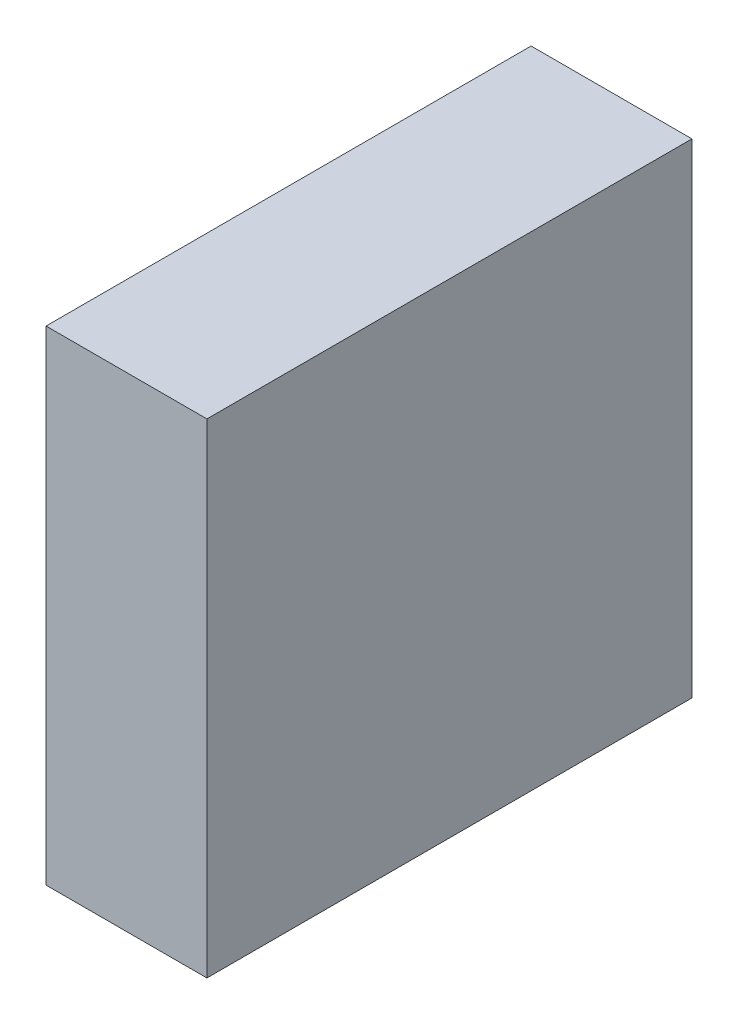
ISO-10303-21;
HEADER;
FILE_DESCRIPTION(('STEP AP214'),'2;1');
FILE_NAME('part.step','',(''),(''),'','','');
FILE_SCHEMA(('AUTOMOTIVE_DESIGN { 1 0 10303 214 1 1 1 1 }'));
ENDSEC;
DATA;
#1=APPLICATION_CONTEXT('core data for automotive mechanical design processes');
#2=APPLICATION_PROTOCOL_DEFINITION('international standard','automotive_design',2000,#1);
#3=PRODUCT_CONTEXT('',#1,'mechanical');
#4=PRODUCT('Part','Part','',(#3));
#5=PRODUCT_RELATED_PRODUCT_CATEGORY('part','',(#4));
#6=PRODUCT_DEFINITION_FORMATION('','',#4);
#7=PRODUCT_DEFINITION_CONTEXT('part definition',#1,'design');
#8=PRODUCT_DEFINITION('design','',#6,#7);
#9=PRODUCT_DEFINITION_SHAPE('','',#8);
#10=(LENGTH_UNIT() NAMED_UNIT(*) SI_UNIT(.MILLI.,.METRE.));
#11=(NAMED_UNIT(*) PLANE_ANGLE_UNIT() SI_UNIT($,.RADIAN.));
#12=(NAMED_UNIT(*) SI_UNIT($,.STERADIAN.) SOLID_ANGLE_UNIT());
#13=UNCERTAINTY_MEASURE_WITH_UNIT(LENGTH_MEASURE(1.E-05),#10,'distance_accuracy_value','');
#14=(GEOMETRIC_REPRESENTATION_CONTEXT(3) GLOBAL_UNCERTAINTY_ASSIGNED_CONTEXT((#13)) GLOBAL_UNIT_ASSIGNED_CONTEXT((#10,
#11,#12)) REPRESENTATION_CONTEXT('',''));
#15=CARTESIAN_POINT('',(0.,0.,0.));
#16=DIRECTION('',(0.,0.,1.));
#17=DIRECTION('',(1.,0.,0.));
#18=AXIS2_PLACEMENT_3D('',#15,#16,#17);
#19=CARTESIAN_POINT('',(0.,0.,0.5999988));
#20=DIRECTION('',(0.,0.,-1.));
#21=DIRECTION('',(0.,-1.,0.));
#22=AXIS2_PLACEMENT_3D('',#19,#20,#21);
#23=PLANE('',#22);
#24=DIRECTION('',(-1.,0.,0.));
#25=VECTOR('',#24,1.);
#26=CARTESIAN_POINT('',(0.09949180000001,-0.2994914,0.5999988));
#27=LINE('',#26,#25);
#28=CARTESIAN_POINT('',(0.09949180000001,-0.2994914,0.5999988));
#29=VERTEX_POINT('',#28);
#30=CARTESIAN_POINT('',(-0.09949179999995,-0.2994914,0.5999988));
#31=VERTEX_POINT('',#30);
#32=EDGE_CURVE('E27',#29,#31,#27,.T.);
#33=ORIENTED_EDGE('',*,*,#32,.F.);
#34=DIRECTION('',(0.,-1.,0.));
#35=VECTOR('',#34,1.);
#36=CARTESIAN_POINT('',(0.09949180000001,0.2994914,0.5999988));
#37=LINE('',#36,#35);
#38=CARTESIAN_POINT('',(0.09949180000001,0.2994914,0.5999988));
#39=VERTEX_POINT('',#38);
#40=EDGE_CURVE('E61',#39,#29,#37,.T.);
#41=ORIENTED_EDGE('',*,*,#40,.F.);
#42=DIRECTION('',(1.,0.,0.));
#43=VECTOR('',#42,1.);
#44=CARTESIAN_POINT('',(-0.09949179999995,0.2994914,0.5999988));
#45=LINE('',#44,#43);
#46=CARTESIAN_POINT('',(-0.09949179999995,0.2994914,0.5999988));
#47=VERTEX_POINT('',#46);
#48=EDGE_CURVE('E65',#47,#39,#45,.T.);
#49=ORIENTED_EDGE('',*,*,#48,.F.);
#50=DIRECTION('',(0.,1.,0.));
#51=VECTOR('',#50,1.);
#52=CARTESIAN_POINT('',(-0.09949179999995,-0.2994914,0.5999988));
#53=LINE('',#52,#51);
#54=EDGE_CURVE('E109',#31,#47,#53,.T.);
#55=ORIENTED_EDGE('',*,*,#54,.F.);
#56=EDGE_LOOP('',(#33,#41,#49,#55));
#57=FACE_BOUND('',#56,.T.);
#58=ADVANCED_FACE('F17',(#57),#23,.F.);
#59=CARTESIAN_POINT('',(0.,0.,0.));
#60=DIRECTION('',(0.,0.,-1.));
#61=DIRECTION('',(0.,-1.,0.));
#62=AXIS2_PLACEMENT_3D('',#59,#60,#61);
#63=PLANE('',#62);
#64=DIRECTION('',(0.,1.,0.));
#65=VECTOR('',#64,1.);
#66=CARTESIAN_POINT('',(-0.09949179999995,-0.2994914,0.));
#67=LINE('',#66,#65);
#68=CARTESIAN_POINT('',(-0.09949179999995,-0.2994914,0.));
#69=VERTEX_POINT('',#68);
#70=CARTESIAN_POINT('',(-0.09949179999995,0.2994914,0.));
#71=VERTEX_POINT('',#70);
#72=EDGE_CURVE('E86',#69,#71,#67,.T.);
#73=ORIENTED_EDGE('',*,*,#72,.T.);
#74=DIRECTION('',(1.,0.,0.));
#75=VECTOR('',#74,1.);
#76=CARTESIAN_POINT('',(-0.09949179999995,0.2994914,0.));
#77=LINE('',#76,#75);
#78=CARTESIAN_POINT('',(0.09949180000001,0.2994914,0.));
#79=VERTEX_POINT('',#78);
#80=EDGE_CURVE('E72',#71,#79,#77,.T.);
#81=ORIENTED_EDGE('',*,*,#80,.T.);
#82=DIRECTION('',(0.,-1.,0.));
#83=VECTOR('',#82,1.);
#84=CARTESIAN_POINT('',(0.09949180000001,0.2994914,0.));
#85=LINE('',#84,#83);
#86=CARTESIAN_POINT('',(0.09949180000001,-0.2994914,0.));
#87=VERTEX_POINT('',#86);
#88=EDGE_CURVE('E76',#79,#87,#85,.T.);
#89=ORIENTED_EDGE('',*,*,#88,.T.);
#90=DIRECTION('',(-1.,0.,0.));
#91=VECTOR('',#90,1.);
#92=CARTESIAN_POINT('',(0.09949180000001,-0.2994914,0.));
#93=LINE('',#92,#91);
#94=EDGE_CURVE('E11',#87,#69,#93,.T.);
#95=ORIENTED_EDGE('',*,*,#94,.T.);
#96=EDGE_LOOP('',(#73,#81,#89,#95));
#97=FACE_BOUND('',#96,.T.);
#98=ADVANCED_FACE('F156',(#97),#63,.T.);
#99=CARTESIAN_POINT('',(0.09949180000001,-0.2994914,0.));
#100=DIRECTION('',(0.,-1.,0.));
#101=DIRECTION('',(0.,0.,-1.));
#102=AXIS2_PLACEMENT_3D('',#99,#100,#101);
#103=PLANE('',#102);
#104=DIRECTION('',(0.,0.,1.));
#105=VECTOR('',#104,1.);
#106=CARTESIAN_POINT('',(0.09949180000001,-0.2994914,0.));
#107=LINE('',#106,#105);
#108=EDGE_CURVE('E71',#87,#29,#107,.T.);
#109=ORIENTED_EDGE('',*,*,#108,.T.);
#110=ORIENTED_EDGE('',*,*,#32,.T.);
#111=DIRECTION('',(0.,0.,1.));
#112=VECTOR('',#111,1.);
#113=CARTESIAN_POINT('',(-0.09949179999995,-0.2994914,0.));
#114=LINE('',#113,#112);
#115=EDGE_CURVE('E108',#69,#31,#114,.T.);
#116=ORIENTED_EDGE('',*,*,#115,.F.);
#117=ORIENTED_EDGE('',*,*,#94,.F.);
#118=EDGE_LOOP('',(#109,#110,#116,#117));
#119=FACE_BOUND('',#118,.T.);
#120=ADVANCED_FACE('F105',(#119),#103,.T.);
#121=CARTESIAN_POINT('',(0.09949180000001,0.2994914,0.));
#122=DIRECTION('',(1.,0.,0.));
#123=DIRECTION('',(0.,1.,0.));
#124=AXIS2_PLACEMENT_3D('',#121,#122,#123);
#125=PLANE('',#124);
#126=DIRECTION('',(0.,0.,1.));
#127=VECTOR('',#126,1.);
#128=CARTESIAN_POINT('',(0.09949180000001,0.2994914,0.));
#129=LINE('',#128,#127);
#130=EDGE_CURVE('E75',#79,#39,#129,.T.);
#131=ORIENTED_EDGE('',*,*,#130,.T.);
#132=ORIENTED_EDGE('',*,*,#40,.T.);
#133=ORIENTED_EDGE('',*,*,#108,.F.);
#134=ORIENTED_EDGE('',*,*,#88,.F.);
#135=EDGE_LOOP('',(#131,#132,#133,#134));
#136=FACE_BOUND('',#135,.T.);
#137=ADVANCED_FACE('F19',(#136),#125,.T.);
#138=CARTESIAN_POINT('',(-0.09949179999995,0.2994914,0.));
#139=DIRECTION('',(0.,1.,0.));
#140=DIRECTION('',(1.,0.,0.));
#141=AXIS2_PLACEMENT_3D('',#138,#139,#140);
#142=PLANE('',#141);
#143=DIRECTION('',(0.,0.,1.));
#144=VECTOR('',#143,1.);
#145=CARTESIAN_POINT('',(-0.09949179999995,0.2994914,0.));
#146=LINE('',#145,#144);
#147=EDGE_CURVE('E83',#71,#47,#146,.T.);
#148=ORIENTED_EDGE('',*,*,#147,.T.);
#149=ORIENTED_EDGE('',*,*,#48,.T.);
#150=ORIENTED_EDGE('',*,*,#130,.F.);
#151=ORIENTED_EDGE('',*,*,#80,.F.);
#152=EDGE_LOOP('',(#148,#149,#150,#151));
#153=FACE_BOUND('',#152,.T.);
#154=ADVANCED_FACE('F81',(#153),#142,.T.);
#155=CARTESIAN_POINT('',(-0.09949179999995,-0.2994914,0.));
#156=DIRECTION('',(-1.,0.,0.));
#157=DIRECTION('',(0.,0.,1.));
#158=AXIS2_PLACEMENT_3D('',#155,#156,#157);
#159=PLANE('',#158);
#160=ORIENTED_EDGE('',*,*,#115,.T.);
#161=ORIENTED_EDGE('',*,*,#54,.T.);
#162=ORIENTED_EDGE('',*,*,#147,.F.);
#163=ORIENTED_EDGE('',*,*,#72,.F.);
#164=EDGE_LOOP('',(#160,#161,#162,#163));
#165=FACE_BOUND('',#164,.T.);
#166=ADVANCED_FACE('F114',(#165),#159,.T.);
#167=CLOSED_SHELL('',(#58,#98,#120,#137,#154,#166));
#168=MANIFOLD_SOLID_BREP('B1',#167);
#169=ADVANCED_BREP_SHAPE_REPRESENTATION('',(#18,#168),#14);
#170=SHAPE_DEFINITION_REPRESENTATION(#9,#169);
ENDSEC;
END-ISO-10303-21;
